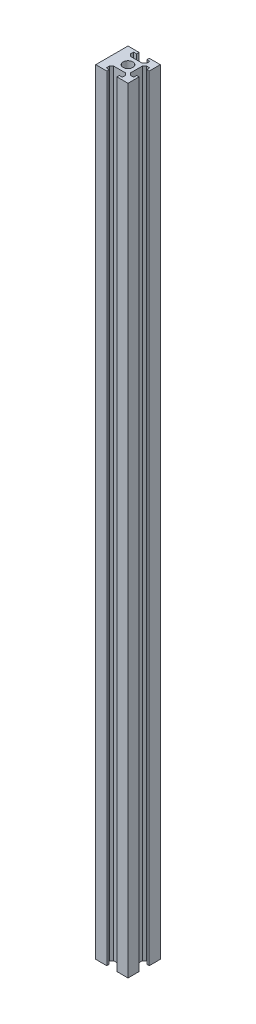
ISO-10303-21;
HEADER;
FILE_DESCRIPTION(('STEP AP214'),'2;1');
FILE_NAME('part.step','',(''),(''),'','','');
FILE_SCHEMA(('AUTOMOTIVE_DESIGN { 1 0 10303 214 1 1 1 1 }'));
ENDSEC;
DATA;
#1=APPLICATION_CONTEXT('core data for automotive mechanical design processes');
#2=APPLICATION_PROTOCOL_DEFINITION('international standard','automotive_design',2000,#1);
#3=PRODUCT_CONTEXT('',#1,'mechanical');
#4=PRODUCT('Part','Part','',(#3));
#5=PRODUCT_RELATED_PRODUCT_CATEGORY('part','',(#4));
#6=PRODUCT_DEFINITION_FORMATION('','',#4);
#7=PRODUCT_DEFINITION_CONTEXT('part definition',#1,'design');
#8=PRODUCT_DEFINITION('design','',#6,#7);
#9=PRODUCT_DEFINITION_SHAPE('','',#8);
#10=(LENGTH_UNIT() NAMED_UNIT(*) SI_UNIT(.MILLI.,.METRE.));
#11=(NAMED_UNIT(*) PLANE_ANGLE_UNIT() SI_UNIT($,.RADIAN.));
#12=(NAMED_UNIT(*) SI_UNIT($,.STERADIAN.) SOLID_ANGLE_UNIT());
#13=UNCERTAINTY_MEASURE_WITH_UNIT(LENGTH_MEASURE(1.E-05),#10,'distance_accuracy_value','');
#14=(GEOMETRIC_REPRESENTATION_CONTEXT(3) GLOBAL_UNCERTAINTY_ASSIGNED_CONTEXT((#13)) GLOBAL_UNIT_ASSIGNED_CONTEXT((#10,
#11,#12)) REPRESENTATION_CONTEXT('',''));
#15=CARTESIAN_POINT('',(0.,0.,0.));
#16=DIRECTION('',(0.,0.,1.));
#17=DIRECTION('',(1.,0.,0.));
#18=AXIS2_PLACEMENT_3D('',#15,#16,#17);
#19=CARTESIAN_POINT('',(0.,480.,0.));
#20=DIRECTION('',(0.,1.,0.));
#21=DIRECTION('',(0.,0.,1.));
#22=AXIS2_PLACEMENT_3D('',#19,#20,#21);
#23=PLANE('',#22);
#24=DIRECTION('',(0.,0.,1.));
#25=VECTOR('',#24,1.);
#26=CARTESIAN_POINT('',(-10.,480.,-10.));
#27=LINE('',#26,#25);
#28=CARTESIAN_POINT('',(-10.,480.,-10.));
#29=VERTEX_POINT('',#28);
#30=CARTESIAN_POINT('',(-10.,480.,10.));
#31=VERTEX_POINT('',#30);
#32=EDGE_CURVE('E353',#29,#31,#27,.T.);
#33=ORIENTED_EDGE('',*,*,#32,.T.);
#34=DIRECTION('',(1.,0.,0.));
#35=VECTOR('',#34,1.);
#36=CARTESIAN_POINT('',(-10.,480.,10.));
#37=LINE('',#36,#35);
#38=CARTESIAN_POINT('',(-3.125,480.,10.));
#39=VERTEX_POINT('',#38);
#40=EDGE_CURVE('E171',#31,#39,#37,.T.);
#41=ORIENTED_EDGE('',*,*,#40,.T.);
#42=DIRECTION('',(0.,0.,-1.));
#43=VECTOR('',#42,1.);
#44=CARTESIAN_POINT('',(-3.125,480.,10.));
#45=LINE('',#44,#43);
#46=CARTESIAN_POINT('',(-3.125,480.,8.5));
#47=VERTEX_POINT('',#46);
#48=EDGE_CURVE('E446',#39,#47,#45,.T.);
#49=ORIENTED_EDGE('',*,*,#48,.T.);
#50=DIRECTION('',(-1.,0.,0.));
#51=VECTOR('',#50,1.);
#52=CARTESIAN_POINT('',(-3.125,480.,8.5));
#53=LINE('',#52,#51);
#54=CARTESIAN_POINT('',(-5.,480.,8.5));
#55=VERTEX_POINT('',#54);
#56=EDGE_CURVE('E465',#47,#55,#53,.T.);
#57=ORIENTED_EDGE('',*,*,#56,.T.);
#58=DIRECTION('',(0.,0.,-1.));
#59=VECTOR('',#58,1.);
#60=CARTESIAN_POINT('',(-5.,480.,8.5));
#61=LINE('',#60,#59);
#62=CARTESIAN_POINT('',(-5.00000000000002,480.,6.50482755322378));
#63=VERTEX_POINT('',#62);
#64=EDGE_CURVE('E462',#55,#63,#61,.T.);
#65=ORIENTED_EDGE('',*,*,#64,.T.);
#66=DIRECTION('',(0.703833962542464,0.,-0.71036452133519));
#67=VECTOR('',#66,1.);
#68=CARTESIAN_POINT('',(-5.00000000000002,480.,6.50482755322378));
#69=LINE('',#68,#67);
#70=CARTESIAN_POINT('',(-3.7071680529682,480.,5.19999999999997));
#71=VERTEX_POINT('',#70);
#72=EDGE_CURVE('E464',#63,#71,#69,.T.);
#73=ORIENTED_EDGE('',*,*,#72,.T.);
#74=DIRECTION('',(1.,0.,0.));
#75=VECTOR('',#74,1.);
#76=CARTESIAN_POINT('',(3.7071680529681,480.,5.20000000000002));
#77=LINE('',#76,#75);
#78=CARTESIAN_POINT('',(3.7071680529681,480.,5.20000000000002));
#79=VERTEX_POINT('',#78);
#80=EDGE_CURVE('E467',#71,#79,#77,.T.);
#81=ORIENTED_EDGE('',*,*,#80,.T.);
#82=DIRECTION('',(0.703833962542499,0.,0.710364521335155));
#83=VECTOR('',#82,1.);
#84=CARTESIAN_POINT('',(5.,480.,6.50482755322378));
#85=LINE('',#84,#83);
#86=CARTESIAN_POINT('',(5.,480.,6.50482755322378));
#87=VERTEX_POINT('',#86);
#88=EDGE_CURVE('E473',#79,#87,#85,.T.);
#89=ORIENTED_EDGE('',*,*,#88,.T.);
#90=DIRECTION('',(0.,0.,1.));
#91=VECTOR('',#90,1.);
#92=CARTESIAN_POINT('',(5.,480.,8.5));
#93=LINE('',#92,#91);
#94=CARTESIAN_POINT('',(5.,480.,8.5));
#95=VERTEX_POINT('',#94);
#96=EDGE_CURVE('E475',#87,#95,#93,.T.);
#97=ORIENTED_EDGE('',*,*,#96,.T.);
#98=DIRECTION('',(-1.,0.,0.));
#99=VECTOR('',#98,1.);
#100=CARTESIAN_POINT('',(3.125,480.,8.5));
#101=LINE('',#100,#99);
#102=CARTESIAN_POINT('',(3.125,480.,8.5));
#103=VERTEX_POINT('',#102);
#104=EDGE_CURVE('E477',#95,#103,#101,.T.);
#105=ORIENTED_EDGE('',*,*,#104,.T.);
#106=DIRECTION('',(0.,0.,1.));
#107=VECTOR('',#106,1.);
#108=CARTESIAN_POINT('',(3.125,480.,10.));
#109=LINE('',#108,#107);
#110=CARTESIAN_POINT('',(3.125,480.,10.));
#111=VERTEX_POINT('',#110);
#112=EDGE_CURVE('E479',#103,#111,#109,.T.);
#113=ORIENTED_EDGE('',*,*,#112,.T.);
#114=DIRECTION('',(1.,0.,0.));
#115=VECTOR('',#114,1.);
#116=CARTESIAN_POINT('',(3.125,480.,10.));
#117=LINE('',#116,#115);
#118=CARTESIAN_POINT('',(10.,480.,10.));
#119=VERTEX_POINT('',#118);
#120=EDGE_CURVE('E481',#111,#119,#117,.T.);
#121=ORIENTED_EDGE('',*,*,#120,.T.);
#122=DIRECTION('',(0.,0.,-1.));
#123=VECTOR('',#122,1.);
#124=CARTESIAN_POINT('',(9.99999999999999,480.,3.12500000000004));
#125=LINE('',#124,#123);
#126=CARTESIAN_POINT('',(9.99999999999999,480.,3.12500000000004));
#127=VERTEX_POINT('',#126);
#128=EDGE_CURVE('E483',#119,#127,#125,.T.);
#129=ORIENTED_EDGE('',*,*,#128,.T.);
#130=DIRECTION('',(-1.,0.,0.));
#131=VECTOR('',#130,1.);
#132=CARTESIAN_POINT('',(9.99999999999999,480.,3.12500000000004));
#133=LINE('',#132,#131);
#134=CARTESIAN_POINT('',(8.49999999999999,480.,3.12500000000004));
#135=VERTEX_POINT('',#134);
#136=EDGE_CURVE('E485',#127,#135,#133,.T.);
#137=ORIENTED_EDGE('',*,*,#136,.T.);
#138=DIRECTION('',(0.,0.,1.));
#139=VECTOR('',#138,1.);
#140=CARTESIAN_POINT('',(8.49999999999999,480.,3.12500000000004));
#141=LINE('',#140,#139);
#142=CARTESIAN_POINT('',(8.49999999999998,480.,5.00000000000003));
#143=VERTEX_POINT('',#142);
#144=EDGE_CURVE('E487',#135,#143,#141,.T.);
#145=ORIENTED_EDGE('',*,*,#144,.T.);
#146=DIRECTION('',(-1.,0.,0.));
#147=VECTOR('',#146,1.);
#148=CARTESIAN_POINT('',(8.49999999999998,480.,5.00000000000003));
#149=LINE('',#148,#147);
#150=CARTESIAN_POINT('',(6.50482755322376,480.,5.00000000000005));
#151=VERTEX_POINT('',#150);
#152=EDGE_CURVE('E489',#143,#151,#149,.T.);
#153=ORIENTED_EDGE('',*,*,#152,.T.);
#154=DIRECTION('',(-0.71036452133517,0.,-0.703833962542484));
#155=VECTOR('',#154,1.);
#156=CARTESIAN_POINT('',(6.50482755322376,480.,5.00000000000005));
#157=LINE('',#156,#155);
#158=CARTESIAN_POINT('',(5.19999999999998,480.,3.70716805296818));
#159=VERTEX_POINT('',#158);
#160=EDGE_CURVE('E491',#151,#159,#157,.T.);
#161=ORIENTED_EDGE('',*,*,#160,.T.);
#162=DIRECTION('',(0.,0.,-1.));
#163=VECTOR('',#162,1.);
#164=CARTESIAN_POINT('',(5.20000000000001,480.,-3.70716805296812));
#165=LINE('',#164,#163);
#166=CARTESIAN_POINT('',(5.20000000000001,480.,-3.70716805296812));
#167=VERTEX_POINT('',#166);
#168=EDGE_CURVE('E493',#159,#167,#165,.T.);
#169=ORIENTED_EDGE('',*,*,#168,.T.);
#170=DIRECTION('',(0.710364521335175,0.,-0.703833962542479));
#171=VECTOR('',#170,1.);
#172=CARTESIAN_POINT('',(6.5048275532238,480.,-4.99999999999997));
#173=LINE('',#172,#171);
#174=CARTESIAN_POINT('',(6.5048275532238,480.,-4.99999999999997));
#175=VERTEX_POINT('',#174);
#176=EDGE_CURVE('E495',#167,#175,#173,.T.);
#177=ORIENTED_EDGE('',*,*,#176,.T.);
#178=DIRECTION('',(1.,0.,0.));
#179=VECTOR('',#178,1.);
#180=CARTESIAN_POINT('',(8.50000000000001,480.,-4.99999999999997));
#181=LINE('',#180,#179);
#182=CARTESIAN_POINT('',(8.50000000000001,480.,-4.99999999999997));
#183=VERTEX_POINT('',#182);
#184=EDGE_CURVE('E497',#175,#183,#181,.T.);
#185=ORIENTED_EDGE('',*,*,#184,.T.);
#186=DIRECTION('',(0.,0.,1.));
#187=VECTOR('',#186,1.);
#188=CARTESIAN_POINT('',(8.50000000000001,480.,-3.12499999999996));
#189=LINE('',#188,#187);
#190=CARTESIAN_POINT('',(8.50000000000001,480.,-3.12499999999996));
#191=VERTEX_POINT('',#190);
#192=EDGE_CURVE('E499',#183,#191,#189,.T.);
#193=ORIENTED_EDGE('',*,*,#192,.T.);
#194=DIRECTION('',(1.,0.,0.));
#195=VECTOR('',#194,1.);
#196=CARTESIAN_POINT('',(10.,480.,-3.12499999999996));
#197=LINE('',#196,#195);
#198=CARTESIAN_POINT('',(10.,480.,-3.12499999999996));
#199=VERTEX_POINT('',#198);
#200=EDGE_CURVE('E501',#191,#199,#197,.T.);
#201=ORIENTED_EDGE('',*,*,#200,.T.);
#202=DIRECTION('',(0.,0.,-1.));
#203=VECTOR('',#202,1.);
#204=CARTESIAN_POINT('',(10.,480.,-10.));
#205=LINE('',#204,#203);
#206=CARTESIAN_POINT('',(10.,480.,-10.));
#207=VERTEX_POINT('',#206);
#208=EDGE_CURVE('E503',#199,#207,#205,.T.);
#209=ORIENTED_EDGE('',*,*,#208,.T.);
#210=DIRECTION('',(-1.,0.,0.));
#211=VECTOR('',#210,1.);
#212=CARTESIAN_POINT('',(3.125,480.,-10.));
#213=LINE('',#212,#211);
#214=CARTESIAN_POINT('',(3.125,480.,-10.));
#215=VERTEX_POINT('',#214);
#216=EDGE_CURVE('E505',#207,#215,#213,.T.);
#217=ORIENTED_EDGE('',*,*,#216,.T.);
#218=DIRECTION('',(0.,0.,1.));
#219=VECTOR('',#218,1.);
#220=CARTESIAN_POINT('',(3.125,480.,-10.));
#221=LINE('',#220,#219);
#222=CARTESIAN_POINT('',(3.12500000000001,480.,-8.5));
#223=VERTEX_POINT('',#222);
#224=EDGE_CURVE('E507',#215,#223,#221,.T.);
#225=ORIENTED_EDGE('',*,*,#224,.T.);
#226=DIRECTION('',(1.,0.,0.));
#227=VECTOR('',#226,1.);
#228=CARTESIAN_POINT('',(3.12500000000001,480.,-8.5));
#229=LINE('',#228,#227);
#230=CARTESIAN_POINT('',(5.00000000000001,480.,-8.5));
#231=VERTEX_POINT('',#230);
#232=EDGE_CURVE('E509',#223,#231,#229,.T.);
#233=ORIENTED_EDGE('',*,*,#232,.T.);
#234=DIRECTION('',(0.,0.,1.));
#235=VECTOR('',#234,1.);
#236=CARTESIAN_POINT('',(5.00000000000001,480.,-8.5));
#237=LINE('',#236,#235);
#238=CARTESIAN_POINT('',(5.00000000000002,480.,-6.50482755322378));
#239=VERTEX_POINT('',#238);
#240=EDGE_CURVE('E511',#231,#239,#237,.T.);
#241=ORIENTED_EDGE('',*,*,#240,.T.);
#242=DIRECTION('',(-0.703833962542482,0.,0.710364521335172));
#243=VECTOR('',#242,1.);
#244=CARTESIAN_POINT('',(5.00000000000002,480.,-6.50482755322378));
#245=LINE('',#244,#243);
#246=CARTESIAN_POINT('',(3.70716805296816,480.,-5.2));
#247=VERTEX_POINT('',#246);
#248=EDGE_CURVE('E513',#239,#247,#245,.T.);
#249=ORIENTED_EDGE('',*,*,#248,.T.);
#250=DIRECTION('',(-1.,0.,0.));
#251=VECTOR('',#250,1.);
#252=CARTESIAN_POINT('',(-3.70716805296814,480.,-5.2));
#253=LINE('',#252,#251);
#254=CARTESIAN_POINT('',(-3.70716805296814,480.,-5.2));
#255=VERTEX_POINT('',#254);
#256=EDGE_CURVE('E515',#247,#255,#253,.T.);
#257=ORIENTED_EDGE('',*,*,#256,.T.);
#258=DIRECTION('',(-0.703833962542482,0.,-0.710364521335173));
#259=VECTOR('',#258,1.);
#260=CARTESIAN_POINT('',(-4.99999999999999,480.,-6.50482755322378));
#261=LINE('',#260,#259);
#262=CARTESIAN_POINT('',(-4.99999999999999,480.,-6.50482755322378));
#263=VERTEX_POINT('',#262);
#264=EDGE_CURVE('E517',#255,#263,#261,.T.);
#265=ORIENTED_EDGE('',*,*,#264,.T.);
#266=DIRECTION('',(0.,0.,-1.));
#267=VECTOR('',#266,1.);
#268=CARTESIAN_POINT('',(-4.99999999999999,480.,-8.5));
#269=LINE('',#268,#267);
#270=CARTESIAN_POINT('',(-4.99999999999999,480.,-8.5));
#271=VERTEX_POINT('',#270);
#272=EDGE_CURVE('E268',#263,#271,#269,.T.);
#273=ORIENTED_EDGE('',*,*,#272,.T.);
#274=DIRECTION('',(1.,0.,0.));
#275=VECTOR('',#274,1.);
#276=CARTESIAN_POINT('',(-3.12499999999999,480.,-8.5));
#277=LINE('',#276,#275);
#278=CARTESIAN_POINT('',(-3.12499999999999,480.,-8.5));
#279=VERTEX_POINT('',#278);
#280=EDGE_CURVE('E262',#271,#279,#277,.T.);
#281=ORIENTED_EDGE('',*,*,#280,.T.);
#282=DIRECTION('',(0.,0.,-1.));
#283=VECTOR('',#282,1.);
#284=CARTESIAN_POINT('',(-3.12499999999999,480.,-10.));
#285=LINE('',#284,#283);
#286=CARTESIAN_POINT('',(-3.12499999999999,480.,-10.));
#287=VERTEX_POINT('',#286);
#288=EDGE_CURVE('E266',#279,#287,#285,.T.);
#289=ORIENTED_EDGE('',*,*,#288,.T.);
#290=DIRECTION('',(-1.,0.,0.));
#291=VECTOR('',#290,1.);
#292=CARTESIAN_POINT('',(-10.,480.,-10.));
#293=LINE('',#292,#291);
#294=EDGE_CURVE('E50',#287,#29,#293,.T.);
#295=ORIENTED_EDGE('',*,*,#294,.T.);
#296=EDGE_LOOP('',(#33,#41,#49,#57,#65,#73,#81,#89,#97,#105,#113,#121,#129,#137,#145,#153,#161,
#169,#177,#185,#193,#201,#209,#217,#225,#233,#241,#249,#257,#265,#273,#281,#289,#295));
#297=FACE_BOUND('',#296,.T.);
#298=CARTESIAN_POINT('',(0.,480.,0.));
#299=DIRECTION('',(0.,1.,0.));
#300=DIRECTION('',(0.,0.,1.));
#301=AXIS2_PLACEMENT_3D('',#298,#299,#300);
#302=CIRCLE('',#301,3.);
#303=CARTESIAN_POINT('',(0.,480.,2.99999999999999));
#304=VERTEX_POINT('',#303);
#305=EDGE_CURVE('E290',#304,#304,#302,.T.);
#306=ORIENTED_EDGE('',*,*,#305,.F.);
#307=EDGE_LOOP('',(#306));
#308=FACE_BOUND('',#307,.T.);
#309=ADVANCED_FACE('F33',(#297,#308),#23,.T.);
#310=CARTESIAN_POINT('',(0.,0.,0.));
#311=DIRECTION('',(0.,1.,0.));
#312=DIRECTION('',(0.,0.,1.));
#313=AXIS2_PLACEMENT_3D('',#310,#311,#312);
#314=PLANE('',#313);
#315=DIRECTION('',(0.,0.,1.));
#316=VECTOR('',#315,1.);
#317=CARTESIAN_POINT('',(-10.,0.,-10.));
#318=LINE('',#317,#316);
#319=CARTESIAN_POINT('',(-10.,0.,-10.));
#320=VERTEX_POINT('',#319);
#321=CARTESIAN_POINT('',(-10.,0.,10.));
#322=VERTEX_POINT('',#321);
#323=EDGE_CURVE('E286',#320,#322,#318,.T.);
#324=ORIENTED_EDGE('',*,*,#323,.F.);
#325=DIRECTION('',(-1.,0.,0.));
#326=VECTOR('',#325,1.);
#327=CARTESIAN_POINT('',(-10.,0.,-10.));
#328=LINE('',#327,#326);
#329=CARTESIAN_POINT('',(-3.12499999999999,0.,-10.));
#330=VERTEX_POINT('',#329);
#331=EDGE_CURVE('E163',#330,#320,#328,.T.);
#332=ORIENTED_EDGE('',*,*,#331,.F.);
#333=DIRECTION('',(0.,0.,-1.));
#334=VECTOR('',#333,1.);
#335=CARTESIAN_POINT('',(-3.12499999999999,0.,-10.));
#336=LINE('',#335,#334);
#337=CARTESIAN_POINT('',(-3.12499999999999,0.,-8.5));
#338=VERTEX_POINT('',#337);
#339=EDGE_CURVE('E157',#338,#330,#336,.T.);
#340=ORIENTED_EDGE('',*,*,#339,.F.);
#341=DIRECTION('',(1.,0.,0.));
#342=VECTOR('',#341,1.);
#343=CARTESIAN_POINT('',(-3.12499999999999,0.,-8.5));
#344=LINE('',#343,#342);
#345=CARTESIAN_POINT('',(-4.99999999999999,0.,-8.5));
#346=VERTEX_POINT('',#345);
#347=EDGE_CURVE('E276',#346,#338,#344,.T.);
#348=ORIENTED_EDGE('',*,*,#347,.F.);
#349=DIRECTION('',(0.,0.,-1.));
#350=VECTOR('',#349,1.);
#351=CARTESIAN_POINT('',(-4.99999999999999,0.,-8.5));
#352=LINE('',#351,#350);
#353=CARTESIAN_POINT('',(-4.99999999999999,0.,-6.50482755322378));
#354=VERTEX_POINT('',#353);
#355=EDGE_CURVE('E348',#354,#346,#352,.T.);
#356=ORIENTED_EDGE('',*,*,#355,.F.);
#357=DIRECTION('',(-0.703833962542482,0.,-0.710364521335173));
#358=VECTOR('',#357,1.);
#359=CARTESIAN_POINT('',(-4.99999999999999,0.,-6.50482755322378));
#360=LINE('',#359,#358);
#361=CARTESIAN_POINT('',(-3.70716805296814,0.,-5.2));
#362=VERTEX_POINT('',#361);
#363=EDGE_CURVE('E346',#362,#354,#360,.T.);
#364=ORIENTED_EDGE('',*,*,#363,.F.);
#365=DIRECTION('',(-1.,0.,0.));
#366=VECTOR('',#365,1.);
#367=CARTESIAN_POINT('',(-3.70716805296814,0.,-5.2));
#368=LINE('',#367,#366);
#369=CARTESIAN_POINT('',(3.70716805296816,0.,-5.2));
#370=VERTEX_POINT('',#369);
#371=EDGE_CURVE('E344',#370,#362,#368,.T.);
#372=ORIENTED_EDGE('',*,*,#371,.F.);
#373=DIRECTION('',(-0.703833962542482,0.,0.710364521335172));
#374=VECTOR('',#373,1.);
#375=CARTESIAN_POINT('',(5.00000000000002,0.,-6.50482755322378));
#376=LINE('',#375,#374);
#377=CARTESIAN_POINT('',(5.00000000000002,0.,-6.50482755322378));
#378=VERTEX_POINT('',#377);
#379=EDGE_CURVE('E342',#378,#370,#376,.T.);
#380=ORIENTED_EDGE('',*,*,#379,.F.);
#381=DIRECTION('',(0.,0.,1.));
#382=VECTOR('',#381,1.);
#383=CARTESIAN_POINT('',(5.00000000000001,0.,-8.5));
#384=LINE('',#383,#382);
#385=CARTESIAN_POINT('',(5.00000000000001,0.,-8.5));
#386=VERTEX_POINT('',#385);
#387=EDGE_CURVE('E340',#386,#378,#384,.T.);
#388=ORIENTED_EDGE('',*,*,#387,.F.);
#389=DIRECTION('',(1.,0.,0.));
#390=VECTOR('',#389,1.);
#391=CARTESIAN_POINT('',(3.12500000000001,0.,-8.5));
#392=LINE('',#391,#390);
#393=CARTESIAN_POINT('',(3.12500000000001,0.,-8.5));
#394=VERTEX_POINT('',#393);
#395=EDGE_CURVE('E338',#394,#386,#392,.T.);
#396=ORIENTED_EDGE('',*,*,#395,.F.);
#397=DIRECTION('',(0.,0.,1.));
#398=VECTOR('',#397,1.);
#399=CARTESIAN_POINT('',(3.125,0.,-10.));
#400=LINE('',#399,#398);
#401=CARTESIAN_POINT('',(3.125,0.,-10.));
#402=VERTEX_POINT('',#401);
#403=EDGE_CURVE('E336',#402,#394,#400,.T.);
#404=ORIENTED_EDGE('',*,*,#403,.F.);
#405=DIRECTION('',(-1.,0.,0.));
#406=VECTOR('',#405,1.);
#407=CARTESIAN_POINT('',(3.125,0.,-10.));
#408=LINE('',#407,#406);
#409=CARTESIAN_POINT('',(10.,0.,-10.));
#410=VERTEX_POINT('',#409);
#411=EDGE_CURVE('E334',#410,#402,#408,.T.);
#412=ORIENTED_EDGE('',*,*,#411,.F.);
#413=DIRECTION('',(0.,0.,-1.));
#414=VECTOR('',#413,1.);
#415=CARTESIAN_POINT('',(10.,0.,-10.));
#416=LINE('',#415,#414);
#417=CARTESIAN_POINT('',(10.,0.,-3.12499999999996));
#418=VERTEX_POINT('',#417);
#419=EDGE_CURVE('E332',#418,#410,#416,.T.);
#420=ORIENTED_EDGE('',*,*,#419,.F.);
#421=DIRECTION('',(1.,0.,0.));
#422=VECTOR('',#421,1.);
#423=CARTESIAN_POINT('',(10.,0.,-3.12499999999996));
#424=LINE('',#423,#422);
#425=CARTESIAN_POINT('',(8.50000000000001,0.,-3.12499999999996));
#426=VERTEX_POINT('',#425);
#427=EDGE_CURVE('E330',#426,#418,#424,.T.);
#428=ORIENTED_EDGE('',*,*,#427,.F.);
#429=DIRECTION('',(0.,0.,1.));
#430=VECTOR('',#429,1.);
#431=CARTESIAN_POINT('',(8.50000000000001,0.,-3.12499999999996));
#432=LINE('',#431,#430);
#433=CARTESIAN_POINT('',(8.50000000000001,0.,-4.99999999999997));
#434=VERTEX_POINT('',#433);
#435=EDGE_CURVE('E328',#434,#426,#432,.T.);
#436=ORIENTED_EDGE('',*,*,#435,.F.);
#437=DIRECTION('',(1.,0.,0.));
#438=VECTOR('',#437,1.);
#439=CARTESIAN_POINT('',(8.50000000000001,0.,-4.99999999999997));
#440=LINE('',#439,#438);
#441=CARTESIAN_POINT('',(6.5048275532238,0.,-4.99999999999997));
#442=VERTEX_POINT('',#441);
#443=EDGE_CURVE('E326',#442,#434,#440,.T.);
#444=ORIENTED_EDGE('',*,*,#443,.F.);
#445=DIRECTION('',(0.710364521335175,0.,-0.703833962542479));
#446=VECTOR('',#445,1.);
#447=CARTESIAN_POINT('',(6.5048275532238,0.,-4.99999999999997));
#448=LINE('',#447,#446);
#449=CARTESIAN_POINT('',(5.20000000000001,0.,-3.70716805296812));
#450=VERTEX_POINT('',#449);
#451=EDGE_CURVE('E324',#450,#442,#448,.T.);
#452=ORIENTED_EDGE('',*,*,#451,.F.);
#453=DIRECTION('',(0.,0.,-1.));
#454=VECTOR('',#453,1.);
#455=CARTESIAN_POINT('',(5.20000000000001,0.,-3.70716805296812));
#456=LINE('',#455,#454);
#457=CARTESIAN_POINT('',(5.19999999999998,0.,3.70716805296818));
#458=VERTEX_POINT('',#457);
#459=EDGE_CURVE('E322',#458,#450,#456,.T.);
#460=ORIENTED_EDGE('',*,*,#459,.F.);
#461=DIRECTION('',(-0.71036452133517,0.,-0.703833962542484));
#462=VECTOR('',#461,1.);
#463=CARTESIAN_POINT('',(6.50482755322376,0.,5.00000000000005));
#464=LINE('',#463,#462);
#465=CARTESIAN_POINT('',(6.50482755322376,0.,5.00000000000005));
#466=VERTEX_POINT('',#465);
#467=EDGE_CURVE('E320',#466,#458,#464,.T.);
#468=ORIENTED_EDGE('',*,*,#467,.F.);
#469=DIRECTION('',(-1.,0.,0.));
#470=VECTOR('',#469,1.);
#471=CARTESIAN_POINT('',(8.49999999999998,0.,5.00000000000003));
#472=LINE('',#471,#470);
#473=CARTESIAN_POINT('',(8.49999999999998,0.,5.00000000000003));
#474=VERTEX_POINT('',#473);
#475=EDGE_CURVE('E318',#474,#466,#472,.T.);
#476=ORIENTED_EDGE('',*,*,#475,.F.);
#477=DIRECTION('',(0.,0.,1.));
#478=VECTOR('',#477,1.);
#479=CARTESIAN_POINT('',(8.49999999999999,0.,3.12500000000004));
#480=LINE('',#479,#478);
#481=CARTESIAN_POINT('',(8.49999999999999,0.,3.12500000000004));
#482=VERTEX_POINT('',#481);
#483=EDGE_CURVE('E316',#482,#474,#480,.T.);
#484=ORIENTED_EDGE('',*,*,#483,.F.);
#485=DIRECTION('',(-1.,0.,0.));
#486=VECTOR('',#485,1.);
#487=CARTESIAN_POINT('',(9.99999999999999,0.,3.12500000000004));
#488=LINE('',#487,#486);
#489=CARTESIAN_POINT('',(9.99999999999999,0.,3.12500000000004));
#490=VERTEX_POINT('',#489);
#491=EDGE_CURVE('E314',#490,#482,#488,.T.);
#492=ORIENTED_EDGE('',*,*,#491,.F.);
#493=DIRECTION('',(0.,0.,-1.));
#494=VECTOR('',#493,1.);
#495=CARTESIAN_POINT('',(9.99999999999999,0.,3.12500000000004));
#496=LINE('',#495,#494);
#497=CARTESIAN_POINT('',(10.,0.,10.));
#498=VERTEX_POINT('',#497);
#499=EDGE_CURVE('E312',#498,#490,#496,.T.);
#500=ORIENTED_EDGE('',*,*,#499,.F.);
#501=DIRECTION('',(1.,0.,0.));
#502=VECTOR('',#501,1.);
#503=CARTESIAN_POINT('',(3.125,0.,10.));
#504=LINE('',#503,#502);
#505=CARTESIAN_POINT('',(3.125,0.,10.));
#506=VERTEX_POINT('',#505);
#507=EDGE_CURVE('E310',#506,#498,#504,.T.);
#508=ORIENTED_EDGE('',*,*,#507,.F.);
#509=DIRECTION('',(0.,0.,1.));
#510=VECTOR('',#509,1.);
#511=CARTESIAN_POINT('',(3.125,0.,10.));
#512=LINE('',#511,#510);
#513=CARTESIAN_POINT('',(3.125,0.,8.5));
#514=VERTEX_POINT('',#513);
#515=EDGE_CURVE('E308',#514,#506,#512,.T.);
#516=ORIENTED_EDGE('',*,*,#515,.F.);
#517=DIRECTION('',(-1.,0.,0.));
#518=VECTOR('',#517,1.);
#519=CARTESIAN_POINT('',(3.125,0.,8.5));
#520=LINE('',#519,#518);
#521=CARTESIAN_POINT('',(5.,0.,8.5));
#522=VERTEX_POINT('',#521);
#523=EDGE_CURVE('E306',#522,#514,#520,.T.);
#524=ORIENTED_EDGE('',*,*,#523,.F.);
#525=DIRECTION('',(0.,0.,1.));
#526=VECTOR('',#525,1.);
#527=CARTESIAN_POINT('',(5.,0.,8.5));
#528=LINE('',#527,#526);
#529=CARTESIAN_POINT('',(5.,0.,6.50482755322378));
#530=VERTEX_POINT('',#529);
#531=EDGE_CURVE('E304',#530,#522,#528,.T.);
#532=ORIENTED_EDGE('',*,*,#531,.F.);
#533=DIRECTION('',(0.703833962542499,0.,0.710364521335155));
#534=VECTOR('',#533,1.);
#535=CARTESIAN_POINT('',(5.,0.,6.50482755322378));
#536=LINE('',#535,#534);
#537=CARTESIAN_POINT('',(3.7071680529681,0.,5.20000000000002));
#538=VERTEX_POINT('',#537);
#539=EDGE_CURVE('E302',#538,#530,#536,.T.);
#540=ORIENTED_EDGE('',*,*,#539,.F.);
#541=DIRECTION('',(1.,0.,0.));
#542=VECTOR('',#541,1.);
#543=CARTESIAN_POINT('',(3.7071680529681,0.,5.20000000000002));
#544=LINE('',#543,#542);
#545=CARTESIAN_POINT('',(-3.7071680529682,0.,5.19999999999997));
#546=VERTEX_POINT('',#545);
#547=EDGE_CURVE('E300',#546,#538,#544,.T.);
#548=ORIENTED_EDGE('',*,*,#547,.F.);
#549=DIRECTION('',(0.703833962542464,0.,-0.71036452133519));
#550=VECTOR('',#549,1.);
#551=CARTESIAN_POINT('',(-5.00000000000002,0.,6.50482755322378));
#552=LINE('',#551,#550);
#553=CARTESIAN_POINT('',(-5.00000000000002,0.,6.50482755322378));
#554=VERTEX_POINT('',#553);
#555=EDGE_CURVE('E298',#554,#546,#552,.T.);
#556=ORIENTED_EDGE('',*,*,#555,.F.);
#557=DIRECTION('',(0.,0.,-1.));
#558=VECTOR('',#557,1.);
#559=CARTESIAN_POINT('',(-5.,0.,8.5));
#560=LINE('',#559,#558);
#561=CARTESIAN_POINT('',(-5.,0.,8.5));
#562=VERTEX_POINT('',#561);
#563=EDGE_CURVE('E296',#562,#554,#560,.T.);
#564=ORIENTED_EDGE('',*,*,#563,.F.);
#565=DIRECTION('',(-1.,0.,0.));
#566=VECTOR('',#565,1.);
#567=CARTESIAN_POINT('',(-3.125,0.,8.5));
#568=LINE('',#567,#566);
#569=CARTESIAN_POINT('',(-3.125,0.,8.5));
#570=VERTEX_POINT('',#569);
#571=EDGE_CURVE('E294',#570,#562,#568,.T.);
#572=ORIENTED_EDGE('',*,*,#571,.F.);
#573=DIRECTION('',(0.,0.,-1.));
#574=VECTOR('',#573,1.);
#575=CARTESIAN_POINT('',(-3.125,0.,10.));
#576=LINE('',#575,#574);
#577=CARTESIAN_POINT('',(-3.125,0.,10.));
#578=VERTEX_POINT('',#577);
#579=EDGE_CURVE('E292',#578,#570,#576,.T.);
#580=ORIENTED_EDGE('',*,*,#579,.F.);
#581=DIRECTION('',(1.,0.,0.));
#582=VECTOR('',#581,1.);
#583=CARTESIAN_POINT('',(-10.,0.,10.));
#584=LINE('',#583,#582);
#585=EDGE_CURVE('E289',#322,#578,#584,.T.);
#586=ORIENTED_EDGE('',*,*,#585,.F.);
#587=EDGE_LOOP('',(#324,#332,#340,#348,#356,#364,#372,#380,#388,#396,#404,#412,#420,#428,#436,
#444,#452,#460,#468,#476,#484,#492,#500,#508,#516,#524,#532,#540,#548,#556,#564,#572,#580,#586));
#588=FACE_BOUND('',#587,.T.);
#589=CARTESIAN_POINT('',(0.,0.,0.));
#590=DIRECTION('',(0.,1.,0.));
#591=DIRECTION('',(0.,0.,1.));
#592=AXIS2_PLACEMENT_3D('',#589,#590,#591);
#593=CIRCLE('',#592,3.);
#594=CARTESIAN_POINT('',(0.,0.,2.99999999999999));
#595=VERTEX_POINT('',#594);
#596=EDGE_CURVE('E950',#595,#595,#593,.T.);
#597=ORIENTED_EDGE('',*,*,#596,.T.);
#598=EDGE_LOOP('',(#597));
#599=FACE_BOUND('',#598,.T.);
#600=ADVANCED_FACE('F450',(#588,#599),#314,.F.);
#601=CARTESIAN_POINT('',(-10.,480.,-10.));
#602=DIRECTION('',(1.,0.,0.));
#603=DIRECTION('',(0.,0.,-1.));
#604=AXIS2_PLACEMENT_3D('',#601,#602,#603);
#605=PLANE('',#604);
#606=ORIENTED_EDGE('',*,*,#323,.T.);
#607=DIRECTION('',(0.,-1.,0.));
#608=VECTOR('',#607,1.);
#609=CARTESIAN_POINT('',(-10.,480.,10.));
#610=LINE('',#609,#608);
#611=EDGE_CURVE('E11',#31,#322,#610,.T.);
#612=ORIENTED_EDGE('',*,*,#611,.F.);
#613=ORIENTED_EDGE('',*,*,#32,.F.);
#614=DIRECTION('',(0.,-1.,0.));
#615=VECTOR('',#614,1.);
#616=CARTESIAN_POINT('',(-10.,480.,-10.));
#617=LINE('',#616,#615);
#618=EDGE_CURVE('E282',#29,#320,#617,.T.);
#619=ORIENTED_EDGE('',*,*,#618,.T.);
#620=EDGE_LOOP('',(#606,#612,#613,#619));
#621=FACE_BOUND('',#620,.T.);
#622=ADVANCED_FACE('F35',(#621),#605,.F.);
#623=CARTESIAN_POINT('',(-10.,480.,10.));
#624=DIRECTION('',(0.,0.,-1.));
#625=DIRECTION('',(-1.,0.,0.));
#626=AXIS2_PLACEMENT_3D('',#623,#624,#625);
#627=PLANE('',#626);
#628=ORIENTED_EDGE('',*,*,#585,.T.);
#629=DIRECTION('',(0.,-1.,0.));
#630=VECTOR('',#629,1.);
#631=CARTESIAN_POINT('',(-3.125,480.,10.));
#632=LINE('',#631,#630);
#633=EDGE_CURVE('E42',#39,#578,#632,.T.);
#634=ORIENTED_EDGE('',*,*,#633,.F.);
#635=ORIENTED_EDGE('',*,*,#40,.F.);
#636=ORIENTED_EDGE('',*,*,#611,.T.);
#637=EDGE_LOOP('',(#628,#634,#635,#636));
#638=FACE_BOUND('',#637,.T.);
#639=ADVANCED_FACE('F551',(#638),#627,.F.);
#640=CARTESIAN_POINT('',(-3.125,480.,10.));
#641=DIRECTION('',(-1.,0.,0.));
#642=DIRECTION('',(0.,0.,1.));
#643=AXIS2_PLACEMENT_3D('',#640,#641,#642);
#644=PLANE('',#643);
#645=ORIENTED_EDGE('',*,*,#579,.T.);
#646=DIRECTION('',(0.,-1.,0.));
#647=VECTOR('',#646,1.);
#648=CARTESIAN_POINT('',(-3.125,480.,8.5));
#649=LINE('',#648,#647);
#650=EDGE_CURVE('E438',#47,#570,#649,.T.);
#651=ORIENTED_EDGE('',*,*,#650,.F.);
#652=ORIENTED_EDGE('',*,*,#48,.F.);
#653=ORIENTED_EDGE('',*,*,#633,.T.);
#654=EDGE_LOOP('',(#645,#651,#652,#653));
#655=FACE_BOUND('',#654,.T.);
#656=ADVANCED_FACE('F444',(#655),#644,.F.);
#657=CARTESIAN_POINT('',(-3.125,480.,8.5));
#658=DIRECTION('',(0.,0.,1.));
#659=DIRECTION('',(1.,0.,0.));
#660=AXIS2_PLACEMENT_3D('',#657,#658,#659);
#661=PLANE('',#660);
#662=ORIENTED_EDGE('',*,*,#571,.T.);
#663=DIRECTION('',(0.,-1.,0.));
#664=VECTOR('',#663,1.);
#665=CARTESIAN_POINT('',(-5.,480.,8.5));
#666=LINE('',#665,#664);
#667=EDGE_CURVE('E435',#55,#562,#666,.T.);
#668=ORIENTED_EDGE('',*,*,#667,.F.);
#669=ORIENTED_EDGE('',*,*,#56,.F.);
#670=ORIENTED_EDGE('',*,*,#650,.T.);
#671=EDGE_LOOP('',(#662,#668,#669,#670));
#672=FACE_BOUND('',#671,.T.);
#673=ADVANCED_FACE('F456',(#672),#661,.F.);
#674=CARTESIAN_POINT('',(-5.,480.,8.5));
#675=DIRECTION('',(-1.,0.,0.));
#676=DIRECTION('',(0.,0.,1.));
#677=AXIS2_PLACEMENT_3D('',#674,#675,#676);
#678=PLANE('',#677);
#679=ORIENTED_EDGE('',*,*,#563,.T.);
#680=DIRECTION('',(0.,-1.,0.));
#681=VECTOR('',#680,1.);
#682=CARTESIAN_POINT('',(-5.00000000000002,480.,6.50482755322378));
#683=LINE('',#682,#681);
#684=EDGE_CURVE('E432',#63,#554,#683,.T.);
#685=ORIENTED_EDGE('',*,*,#684,.F.);
#686=ORIENTED_EDGE('',*,*,#64,.F.);
#687=ORIENTED_EDGE('',*,*,#667,.T.);
#688=EDGE_LOOP('',(#679,#685,#686,#687));
#689=FACE_BOUND('',#688,.T.);
#690=ADVANCED_FACE('F460',(#689),#678,.F.);
#691=CARTESIAN_POINT('',(-5.00000000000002,480.,6.50482755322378));
#692=DIRECTION('',(-0.71036452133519,0.,-0.703833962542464));
#693=DIRECTION('',(-0.703833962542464,0.,0.71036452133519));
#694=AXIS2_PLACEMENT_3D('',#691,#692,#693);
#695=PLANE('',#694);
#696=ORIENTED_EDGE('',*,*,#555,.T.);
#697=DIRECTION('',(0.,-1.,0.));
#698=VECTOR('',#697,1.);
#699=CARTESIAN_POINT('',(-3.7071680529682,480.,5.19999999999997));
#700=LINE('',#699,#698);
#701=EDGE_CURVE('E429',#71,#546,#700,.T.);
#702=ORIENTED_EDGE('',*,*,#701,.F.);
#703=ORIENTED_EDGE('',*,*,#72,.F.);
#704=ORIENTED_EDGE('',*,*,#684,.T.);
#705=EDGE_LOOP('',(#696,#702,#703,#704));
#706=FACE_BOUND('',#705,.T.);
#707=ADVANCED_FACE('F564',(#706),#695,.F.);
#708=CARTESIAN_POINT('',(3.7071680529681,480.,5.20000000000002));
#709=DIRECTION('',(0.,0.,-1.));
#710=DIRECTION('',(-1.,0.,0.));
#711=AXIS2_PLACEMENT_3D('',#708,#709,#710);
#712=PLANE('',#711);
#713=ORIENTED_EDGE('',*,*,#547,.T.);
#714=DIRECTION('',(0.,-1.,0.));
#715=VECTOR('',#714,1.);
#716=CARTESIAN_POINT('',(3.7071680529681,480.,5.20000000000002));
#717=LINE('',#716,#715);
#718=EDGE_CURVE('E426',#79,#538,#717,.T.);
#719=ORIENTED_EDGE('',*,*,#718,.F.);
#720=ORIENTED_EDGE('',*,*,#80,.F.);
#721=ORIENTED_EDGE('',*,*,#701,.T.);
#722=EDGE_LOOP('',(#713,#719,#720,#721));
#723=FACE_BOUND('',#722,.T.);
#724=ADVANCED_FACE('F567',(#723),#712,.F.);
#725=CARTESIAN_POINT('',(5.,480.,6.50482755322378));
#726=DIRECTION('',(0.710364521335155,0.,-0.703833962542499));
#727=DIRECTION('',(-0.703833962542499,0.,-0.710364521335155));
#728=AXIS2_PLACEMENT_3D('',#725,#726,#727);
#729=PLANE('',#728);
#730=ORIENTED_EDGE('',*,*,#539,.T.);
#731=DIRECTION('',(0.,-1.,0.));
#732=VECTOR('',#731,1.);
#733=CARTESIAN_POINT('',(5.,480.,6.50482755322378));
#734=LINE('',#733,#732);
#735=EDGE_CURVE('E423',#87,#530,#734,.T.);
#736=ORIENTED_EDGE('',*,*,#735,.F.);
#737=ORIENTED_EDGE('',*,*,#88,.F.);
#738=ORIENTED_EDGE('',*,*,#718,.T.);
#739=EDGE_LOOP('',(#730,#736,#737,#738));
#740=FACE_BOUND('',#739,.T.);
#741=ADVANCED_FACE('F571',(#740),#729,.F.);
#742=CARTESIAN_POINT('',(5.,480.,8.5));
#743=DIRECTION('',(1.,0.,0.));
#744=DIRECTION('',(0.,0.,-1.));
#745=AXIS2_PLACEMENT_3D('',#742,#743,#744);
#746=PLANE('',#745);
#747=ORIENTED_EDGE('',*,*,#531,.T.);
#748=DIRECTION('',(0.,-1.,0.));
#749=VECTOR('',#748,1.);
#750=CARTESIAN_POINT('',(5.,480.,8.5));
#751=LINE('',#750,#749);
#752=EDGE_CURVE('E420',#95,#522,#751,.T.);
#753=ORIENTED_EDGE('',*,*,#752,.F.);
#754=ORIENTED_EDGE('',*,*,#96,.F.);
#755=ORIENTED_EDGE('',*,*,#735,.T.);
#756=EDGE_LOOP('',(#747,#753,#754,#755));
#757=FACE_BOUND('',#756,.T.);
#758=ADVANCED_FACE('F575',(#757),#746,.F.);
#759=CARTESIAN_POINT('',(3.125,480.,8.5));
#760=DIRECTION('',(0.,0.,1.));
#761=DIRECTION('',(1.,0.,0.));
#762=AXIS2_PLACEMENT_3D('',#759,#760,#761);
#763=PLANE('',#762);
#764=ORIENTED_EDGE('',*,*,#523,.T.);
#765=DIRECTION('',(0.,-1.,0.));
#766=VECTOR('',#765,1.);
#767=CARTESIAN_POINT('',(3.125,480.,8.5));
#768=LINE('',#767,#766);
#769=EDGE_CURVE('E417',#103,#514,#768,.T.);
#770=ORIENTED_EDGE('',*,*,#769,.F.);
#771=ORIENTED_EDGE('',*,*,#104,.F.);
#772=ORIENTED_EDGE('',*,*,#752,.T.);
#773=EDGE_LOOP('',(#764,#770,#771,#772));
#774=FACE_BOUND('',#773,.T.);
#775=ADVANCED_FACE('F579',(#774),#763,.F.);
#776=CARTESIAN_POINT('',(3.125,480.,10.));
#777=DIRECTION('',(1.,0.,0.));
#778=DIRECTION('',(0.,0.,-1.));
#779=AXIS2_PLACEMENT_3D('',#776,#777,#778);
#780=PLANE('',#779);
#781=ORIENTED_EDGE('',*,*,#515,.T.);
#782=DIRECTION('',(0.,-1.,0.));
#783=VECTOR('',#782,1.);
#784=CARTESIAN_POINT('',(3.125,480.,10.));
#785=LINE('',#784,#783);
#786=EDGE_CURVE('E414',#111,#506,#785,.T.);
#787=ORIENTED_EDGE('',*,*,#786,.F.);
#788=ORIENTED_EDGE('',*,*,#112,.F.);
#789=ORIENTED_EDGE('',*,*,#769,.T.);
#790=EDGE_LOOP('',(#781,#787,#788,#789));
#791=FACE_BOUND('',#790,.T.);
#792=ADVANCED_FACE('F583',(#791),#780,.F.);
#793=CARTESIAN_POINT('',(3.125,480.,10.));
#794=DIRECTION('',(0.,0.,-1.));
#795=DIRECTION('',(-1.,0.,0.));
#796=AXIS2_PLACEMENT_3D('',#793,#794,#795);
#797=PLANE('',#796);
#798=ORIENTED_EDGE('',*,*,#507,.T.);
#799=DIRECTION('',(0.,-1.,0.));
#800=VECTOR('',#799,1.);
#801=CARTESIAN_POINT('',(10.,480.,10.));
#802=LINE('',#801,#800);
#803=EDGE_CURVE('E411',#119,#498,#802,.T.);
#804=ORIENTED_EDGE('',*,*,#803,.F.);
#805=ORIENTED_EDGE('',*,*,#120,.F.);
#806=ORIENTED_EDGE('',*,*,#786,.T.);
#807=EDGE_LOOP('',(#798,#804,#805,#806));
#808=FACE_BOUND('',#807,.T.);
#809=ADVANCED_FACE('F587',(#808),#797,.F.);
#810=CARTESIAN_POINT('',(9.99999999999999,480.,3.12500000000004));
#811=DIRECTION('',(-1.,0.,0.));
#812=DIRECTION('',(0.,0.,1.));
#813=AXIS2_PLACEMENT_3D('',#810,#811,#812);
#814=PLANE('',#813);
#815=ORIENTED_EDGE('',*,*,#499,.T.);
#816=DIRECTION('',(0.,-1.,0.));
#817=VECTOR('',#816,1.);
#818=CARTESIAN_POINT('',(9.99999999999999,480.,3.12500000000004));
#819=LINE('',#818,#817);
#820=EDGE_CURVE('E408',#127,#490,#819,.T.);
#821=ORIENTED_EDGE('',*,*,#820,.F.);
#822=ORIENTED_EDGE('',*,*,#128,.F.);
#823=ORIENTED_EDGE('',*,*,#803,.T.);
#824=EDGE_LOOP('',(#815,#821,#822,#823));
#825=FACE_BOUND('',#824,.T.);
#826=ADVANCED_FACE('F591',(#825),#814,.F.);
#827=CARTESIAN_POINT('',(9.99999999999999,480.,3.12500000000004));
#828=DIRECTION('',(0.,0.,1.));
#829=DIRECTION('',(1.,0.,0.));
#830=AXIS2_PLACEMENT_3D('',#827,#828,#829);
#831=PLANE('',#830);
#832=ORIENTED_EDGE('',*,*,#491,.T.);
#833=DIRECTION('',(0.,-1.,0.));
#834=VECTOR('',#833,1.);
#835=CARTESIAN_POINT('',(8.49999999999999,480.,3.12500000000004));
#836=LINE('',#835,#834);
#837=EDGE_CURVE('E405',#135,#482,#836,.T.);
#838=ORIENTED_EDGE('',*,*,#837,.F.);
#839=ORIENTED_EDGE('',*,*,#136,.F.);
#840=ORIENTED_EDGE('',*,*,#820,.T.);
#841=EDGE_LOOP('',(#832,#838,#839,#840));
#842=FACE_BOUND('',#841,.T.);
#843=ADVANCED_FACE('F595',(#842),#831,.F.);
#844=CARTESIAN_POINT('',(8.49999999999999,480.,3.12500000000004));
#845=DIRECTION('',(1.,0.,0.));
#846=DIRECTION('',(0.,0.,-1.));
#847=AXIS2_PLACEMENT_3D('',#844,#845,#846);
#848=PLANE('',#847);
#849=ORIENTED_EDGE('',*,*,#483,.T.);
#850=DIRECTION('',(0.,-1.,0.));
#851=VECTOR('',#850,1.);
#852=CARTESIAN_POINT('',(8.49999999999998,480.,5.00000000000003));
#853=LINE('',#852,#851);
#854=EDGE_CURVE('E402',#143,#474,#853,.T.);
#855=ORIENTED_EDGE('',*,*,#854,.F.);
#856=ORIENTED_EDGE('',*,*,#144,.F.);
#857=ORIENTED_EDGE('',*,*,#837,.T.);
#858=EDGE_LOOP('',(#849,#855,#856,#857));
#859=FACE_BOUND('',#858,.T.);
#860=ADVANCED_FACE('F599',(#859),#848,.F.);
#861=CARTESIAN_POINT('',(8.49999999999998,480.,5.00000000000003));
#862=DIRECTION('',(0.,0.,1.));
#863=DIRECTION('',(1.,0.,0.));
#864=AXIS2_PLACEMENT_3D('',#861,#862,#863);
#865=PLANE('',#864);
#866=ORIENTED_EDGE('',*,*,#475,.T.);
#867=DIRECTION('',(0.,-1.,0.));
#868=VECTOR('',#867,1.);
#869=CARTESIAN_POINT('',(6.50482755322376,480.,5.00000000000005));
#870=LINE('',#869,#868);
#871=EDGE_CURVE('E399',#151,#466,#870,.T.);
#872=ORIENTED_EDGE('',*,*,#871,.F.);
#873=ORIENTED_EDGE('',*,*,#152,.F.);
#874=ORIENTED_EDGE('',*,*,#854,.T.);
#875=EDGE_LOOP('',(#866,#872,#873,#874));
#876=FACE_BOUND('',#875,.T.);
#877=ADVANCED_FACE('F603',(#876),#865,.F.);
#878=CARTESIAN_POINT('',(6.50482755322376,480.,5.00000000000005));
#879=DIRECTION('',(-0.703833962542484,0.,0.71036452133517));
#880=DIRECTION('',(0.71036452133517,0.,0.703833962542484));
#881=AXIS2_PLACEMENT_3D('',#878,#879,#880);
#882=PLANE('',#881);
#883=ORIENTED_EDGE('',*,*,#467,.T.);
#884=DIRECTION('',(0.,-1.,0.));
#885=VECTOR('',#884,1.);
#886=CARTESIAN_POINT('',(5.19999999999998,480.,3.70716805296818));
#887=LINE('',#886,#885);
#888=EDGE_CURVE('E396',#159,#458,#887,.T.);
#889=ORIENTED_EDGE('',*,*,#888,.F.);
#890=ORIENTED_EDGE('',*,*,#160,.F.);
#891=ORIENTED_EDGE('',*,*,#871,.T.);
#892=EDGE_LOOP('',(#883,#889,#890,#891));
#893=FACE_BOUND('',#892,.T.);
#894=ADVANCED_FACE('F607',(#893),#882,.F.);
#895=CARTESIAN_POINT('',(5.20000000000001,480.,-3.70716805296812));
#896=DIRECTION('',(-1.,0.,0.));
#897=DIRECTION('',(0.,0.,1.));
#898=AXIS2_PLACEMENT_3D('',#895,#896,#897);
#899=PLANE('',#898);
#900=ORIENTED_EDGE('',*,*,#459,.T.);
#901=DIRECTION('',(0.,-1.,0.));
#902=VECTOR('',#901,1.);
#903=CARTESIAN_POINT('',(5.20000000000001,480.,-3.70716805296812));
#904=LINE('',#903,#902);
#905=EDGE_CURVE('E393',#167,#450,#904,.T.);
#906=ORIENTED_EDGE('',*,*,#905,.F.);
#907=ORIENTED_EDGE('',*,*,#168,.F.);
#908=ORIENTED_EDGE('',*,*,#888,.T.);
#909=EDGE_LOOP('',(#900,#906,#907,#908));
#910=FACE_BOUND('',#909,.T.);
#911=ADVANCED_FACE('F611',(#910),#899,.F.);
#912=CARTESIAN_POINT('',(6.5048275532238,480.,-4.99999999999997));
#913=DIRECTION('',(-0.703833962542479,0.,-0.710364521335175));
#914=DIRECTION('',(-0.710364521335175,0.,0.703833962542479));
#915=AXIS2_PLACEMENT_3D('',#912,#913,#914);
#916=PLANE('',#915);
#917=ORIENTED_EDGE('',*,*,#451,.T.);
#918=DIRECTION('',(0.,-1.,0.));
#919=VECTOR('',#918,1.);
#920=CARTESIAN_POINT('',(6.5048275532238,480.,-4.99999999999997));
#921=LINE('',#920,#919);
#922=EDGE_CURVE('E390',#175,#442,#921,.T.);
#923=ORIENTED_EDGE('',*,*,#922,.F.);
#924=ORIENTED_EDGE('',*,*,#176,.F.);
#925=ORIENTED_EDGE('',*,*,#905,.T.);
#926=EDGE_LOOP('',(#917,#923,#924,#925));
#927=FACE_BOUND('',#926,.T.);
#928=ADVANCED_FACE('F615',(#927),#916,.F.);
#929=CARTESIAN_POINT('',(8.50000000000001,480.,-4.99999999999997));
#930=DIRECTION('',(0.,0.,-1.));
#931=DIRECTION('',(-1.,0.,0.));
#932=AXIS2_PLACEMENT_3D('',#929,#930,#931);
#933=PLANE('',#932);
#934=ORIENTED_EDGE('',*,*,#443,.T.);
#935=DIRECTION('',(0.,-1.,0.));
#936=VECTOR('',#935,1.);
#937=CARTESIAN_POINT('',(8.50000000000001,480.,-4.99999999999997));
#938=LINE('',#937,#936);
#939=EDGE_CURVE('E387',#183,#434,#938,.T.);
#940=ORIENTED_EDGE('',*,*,#939,.F.);
#941=ORIENTED_EDGE('',*,*,#184,.F.);
#942=ORIENTED_EDGE('',*,*,#922,.T.);
#943=EDGE_LOOP('',(#934,#940,#941,#942));
#944=FACE_BOUND('',#943,.T.);
#945=ADVANCED_FACE('F619',(#944),#933,.F.);
#946=CARTESIAN_POINT('',(8.50000000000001,480.,-3.12499999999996));
#947=DIRECTION('',(1.,0.,0.));
#948=DIRECTION('',(0.,0.,-1.));
#949=AXIS2_PLACEMENT_3D('',#946,#947,#948);
#950=PLANE('',#949);
#951=ORIENTED_EDGE('',*,*,#435,.T.);
#952=DIRECTION('',(0.,-1.,0.));
#953=VECTOR('',#952,1.);
#954=CARTESIAN_POINT('',(8.50000000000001,480.,-3.12499999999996));
#955=LINE('',#954,#953);
#956=EDGE_CURVE('E384',#191,#426,#955,.T.);
#957=ORIENTED_EDGE('',*,*,#956,.F.);
#958=ORIENTED_EDGE('',*,*,#192,.F.);
#959=ORIENTED_EDGE('',*,*,#939,.T.);
#960=EDGE_LOOP('',(#951,#957,#958,#959));
#961=FACE_BOUND('',#960,.T.);
#962=ADVANCED_FACE('F623',(#961),#950,.F.);
#963=CARTESIAN_POINT('',(10.,480.,-3.12499999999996));
#964=DIRECTION('',(0.,0.,-1.));
#965=DIRECTION('',(-1.,0.,0.));
#966=AXIS2_PLACEMENT_3D('',#963,#964,#965);
#967=PLANE('',#966);
#968=ORIENTED_EDGE('',*,*,#427,.T.);
#969=DIRECTION('',(0.,-1.,0.));
#970=VECTOR('',#969,1.);
#971=CARTESIAN_POINT('',(10.,480.,-3.12499999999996));
#972=LINE('',#971,#970);
#973=EDGE_CURVE('E381',#199,#418,#972,.T.);
#974=ORIENTED_EDGE('',*,*,#973,.F.);
#975=ORIENTED_EDGE('',*,*,#200,.F.);
#976=ORIENTED_EDGE('',*,*,#956,.T.);
#977=EDGE_LOOP('',(#968,#974,#975,#976));
#978=FACE_BOUND('',#977,.T.);
#979=ADVANCED_FACE('F627',(#978),#967,.F.);
#980=CARTESIAN_POINT('',(10.,480.,-10.));
#981=DIRECTION('',(-1.,0.,0.));
#982=DIRECTION('',(0.,0.,1.));
#983=AXIS2_PLACEMENT_3D('',#980,#981,#982);
#984=PLANE('',#983);
#985=ORIENTED_EDGE('',*,*,#419,.T.);
#986=DIRECTION('',(0.,-1.,0.));
#987=VECTOR('',#986,1.);
#988=CARTESIAN_POINT('',(10.,480.,-10.));
#989=LINE('',#988,#987);
#990=EDGE_CURVE('E378',#207,#410,#989,.T.);
#991=ORIENTED_EDGE('',*,*,#990,.F.);
#992=ORIENTED_EDGE('',*,*,#208,.F.);
#993=ORIENTED_EDGE('',*,*,#973,.T.);
#994=EDGE_LOOP('',(#985,#991,#992,#993));
#995=FACE_BOUND('',#994,.T.);
#996=ADVANCED_FACE('F631',(#995),#984,.F.);
#997=CARTESIAN_POINT('',(3.125,480.,-10.));
#998=DIRECTION('',(0.,0.,1.));
#999=DIRECTION('',(1.,0.,0.));
#1000=AXIS2_PLACEMENT_3D('',#997,#998,#999);
#1001=PLANE('',#1000);
#1002=ORIENTED_EDGE('',*,*,#411,.T.);
#1003=DIRECTION('',(0.,-1.,0.));
#1004=VECTOR('',#1003,1.);
#1005=CARTESIAN_POINT('',(3.125,480.,-10.));
#1006=LINE('',#1005,#1004);
#1007=EDGE_CURVE('E375',#215,#402,#1006,.T.);
#1008=ORIENTED_EDGE('',*,*,#1007,.F.);
#1009=ORIENTED_EDGE('',*,*,#216,.F.);
#1010=ORIENTED_EDGE('',*,*,#990,.T.);
#1011=EDGE_LOOP('',(#1002,#1008,#1009,#1010));
#1012=FACE_BOUND('',#1011,.T.);
#1013=ADVANCED_FACE('F635',(#1012),#1001,.F.);
#1014=CARTESIAN_POINT('',(3.125,480.,-10.));
#1015=DIRECTION('',(1.,0.,0.));
#1016=DIRECTION('',(0.,0.,-1.));
#1017=AXIS2_PLACEMENT_3D('',#1014,#1015,#1016);
#1018=PLANE('',#1017);
#1019=ORIENTED_EDGE('',*,*,#403,.T.);
#1020=DIRECTION('',(0.,-1.,0.));
#1021=VECTOR('',#1020,1.);
#1022=CARTESIAN_POINT('',(3.12500000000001,480.,-8.5));
#1023=LINE('',#1022,#1021);
#1024=EDGE_CURVE('E372',#223,#394,#1023,.T.);
#1025=ORIENTED_EDGE('',*,*,#1024,.F.);
#1026=ORIENTED_EDGE('',*,*,#224,.F.);
#1027=ORIENTED_EDGE('',*,*,#1007,.T.);
#1028=EDGE_LOOP('',(#1019,#1025,#1026,#1027));
#1029=FACE_BOUND('',#1028,.T.);
#1030=ADVANCED_FACE('F639',(#1029),#1018,.F.);
#1031=CARTESIAN_POINT('',(3.12500000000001,480.,-8.5));
#1032=DIRECTION('',(0.,0.,-1.));
#1033=DIRECTION('',(-1.,0.,0.));
#1034=AXIS2_PLACEMENT_3D('',#1031,#1032,#1033);
#1035=PLANE('',#1034);
#1036=ORIENTED_EDGE('',*,*,#395,.T.);
#1037=DIRECTION('',(0.,-1.,0.));
#1038=VECTOR('',#1037,1.);
#1039=CARTESIAN_POINT('',(5.00000000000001,480.,-8.5));
#1040=LINE('',#1039,#1038);
#1041=EDGE_CURVE('E369',#231,#386,#1040,.T.);
#1042=ORIENTED_EDGE('',*,*,#1041,.F.);
#1043=ORIENTED_EDGE('',*,*,#232,.F.);
#1044=ORIENTED_EDGE('',*,*,#1024,.T.);
#1045=EDGE_LOOP('',(#1036,#1042,#1043,#1044));
#1046=FACE_BOUND('',#1045,.T.);
#1047=ADVANCED_FACE('F643',(#1046),#1035,.F.);
#1048=CARTESIAN_POINT('',(5.00000000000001,480.,-8.5));
#1049=DIRECTION('',(1.,0.,0.));
#1050=DIRECTION('',(0.,0.,-1.));
#1051=AXIS2_PLACEMENT_3D('',#1048,#1049,#1050);
#1052=PLANE('',#1051);
#1053=ORIENTED_EDGE('',*,*,#387,.T.);
#1054=DIRECTION('',(0.,-1.,0.));
#1055=VECTOR('',#1054,1.);
#1056=CARTESIAN_POINT('',(5.00000000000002,480.,-6.50482755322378));
#1057=LINE('',#1056,#1055);
#1058=EDGE_CURVE('E366',#239,#378,#1057,.T.);
#1059=ORIENTED_EDGE('',*,*,#1058,.F.);
#1060=ORIENTED_EDGE('',*,*,#240,.F.);
#1061=ORIENTED_EDGE('',*,*,#1041,.T.);
#1062=EDGE_LOOP('',(#1053,#1059,#1060,#1061));
#1063=FACE_BOUND('',#1062,.T.);
#1064=ADVANCED_FACE('F647',(#1063),#1052,.F.);
#1065=CARTESIAN_POINT('',(5.00000000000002,480.,-6.50482755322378));
#1066=DIRECTION('',(0.710364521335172,0.,0.703833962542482));
#1067=DIRECTION('',(0.703833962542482,0.,-0.710364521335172));
#1068=AXIS2_PLACEMENT_3D('',#1065,#1066,#1067);
#1069=PLANE('',#1068);
#1070=ORIENTED_EDGE('',*,*,#379,.T.);
#1071=DIRECTION('',(0.,-1.,0.));
#1072=VECTOR('',#1071,1.);
#1073=CARTESIAN_POINT('',(3.70716805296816,480.,-5.2));
#1074=LINE('',#1073,#1072);
#1075=EDGE_CURVE('E363',#247,#370,#1074,.T.);
#1076=ORIENTED_EDGE('',*,*,#1075,.F.);
#1077=ORIENTED_EDGE('',*,*,#248,.F.);
#1078=ORIENTED_EDGE('',*,*,#1058,.T.);
#1079=EDGE_LOOP('',(#1070,#1076,#1077,#1078));
#1080=FACE_BOUND('',#1079,.T.);
#1081=ADVANCED_FACE('F651',(#1080),#1069,.F.);
#1082=CARTESIAN_POINT('',(-3.70716805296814,480.,-5.2));
#1083=DIRECTION('',(0.,0.,1.));
#1084=DIRECTION('',(1.,0.,0.));
#1085=AXIS2_PLACEMENT_3D('',#1082,#1083,#1084);
#1086=PLANE('',#1085);
#1087=ORIENTED_EDGE('',*,*,#371,.T.);
#1088=DIRECTION('',(0.,-1.,0.));
#1089=VECTOR('',#1088,1.);
#1090=CARTESIAN_POINT('',(-3.70716805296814,480.,-5.2));
#1091=LINE('',#1090,#1089);
#1092=EDGE_CURVE('E360',#255,#362,#1091,.T.);
#1093=ORIENTED_EDGE('',*,*,#1092,.F.);
#1094=ORIENTED_EDGE('',*,*,#256,.F.);
#1095=ORIENTED_EDGE('',*,*,#1075,.T.);
#1096=EDGE_LOOP('',(#1087,#1093,#1094,#1095));
#1097=FACE_BOUND('',#1096,.T.);
#1098=ADVANCED_FACE('F655',(#1097),#1086,.F.);
#1099=CARTESIAN_POINT('',(-4.99999999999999,480.,-6.50482755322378));
#1100=DIRECTION('',(-0.710364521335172,0.,0.703833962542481));
#1101=DIRECTION('',(0.703833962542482,0.,0.710364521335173));
#1102=AXIS2_PLACEMENT_3D('',#1099,#1100,#1101);
#1103=PLANE('',#1102);
#1104=ORIENTED_EDGE('',*,*,#363,.T.);
#1105=DIRECTION('',(0.,-1.,0.));
#1106=VECTOR('',#1105,1.);
#1107=CARTESIAN_POINT('',(-4.99999999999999,480.,-6.50482755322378));
#1108=LINE('',#1107,#1106);
#1109=EDGE_CURVE('E357',#263,#354,#1108,.T.);
#1110=ORIENTED_EDGE('',*,*,#1109,.F.);
#1111=ORIENTED_EDGE('',*,*,#264,.F.);
#1112=ORIENTED_EDGE('',*,*,#1092,.T.);
#1113=EDGE_LOOP('',(#1104,#1110,#1111,#1112));
#1114=FACE_BOUND('',#1113,.T.);
#1115=ADVANCED_FACE('F523',(#1114),#1103,.F.);
#1116=CARTESIAN_POINT('',(-4.99999999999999,480.,-8.5));
#1117=DIRECTION('',(-1.,0.,0.));
#1118=DIRECTION('',(0.,0.,1.));
#1119=AXIS2_PLACEMENT_3D('',#1116,#1117,#1118);
#1120=PLANE('',#1119);
#1121=ORIENTED_EDGE('',*,*,#355,.T.);
#1122=DIRECTION('',(0.,-1.,0.));
#1123=VECTOR('',#1122,1.);
#1124=CARTESIAN_POINT('',(-4.99999999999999,480.,-8.5));
#1125=LINE('',#1124,#1123);
#1126=EDGE_CURVE('E277',#271,#346,#1125,.T.);
#1127=ORIENTED_EDGE('',*,*,#1126,.F.);
#1128=ORIENTED_EDGE('',*,*,#272,.F.);
#1129=ORIENTED_EDGE('',*,*,#1109,.T.);
#1130=EDGE_LOOP('',(#1121,#1127,#1128,#1129));
#1131=FACE_BOUND('',#1130,.T.);
#1132=ADVANCED_FACE('F527',(#1131),#1120,.F.);
#1133=CARTESIAN_POINT('',(-3.12499999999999,480.,-8.5));
#1134=DIRECTION('',(0.,0.,-1.));
#1135=DIRECTION('',(-1.,0.,0.));
#1136=AXIS2_PLACEMENT_3D('',#1133,#1134,#1135);
#1137=PLANE('',#1136);
#1138=ORIENTED_EDGE('',*,*,#347,.T.);
#1139=DIRECTION('',(0.,-1.,0.));
#1140=VECTOR('',#1139,1.);
#1141=CARTESIAN_POINT('',(-3.12499999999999,480.,-8.5));
#1142=LINE('',#1141,#1140);
#1143=EDGE_CURVE('E273',#279,#338,#1142,.T.);
#1144=ORIENTED_EDGE('',*,*,#1143,.F.);
#1145=ORIENTED_EDGE('',*,*,#280,.F.);
#1146=ORIENTED_EDGE('',*,*,#1126,.T.);
#1147=EDGE_LOOP('',(#1138,#1144,#1145,#1146));
#1148=FACE_BOUND('',#1147,.T.);
#1149=ADVANCED_FACE('F274',(#1148),#1137,.F.);
#1150=CARTESIAN_POINT('',(-3.12499999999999,480.,-10.));
#1151=DIRECTION('',(-1.,0.,0.));
#1152=DIRECTION('',(0.,0.,1.));
#1153=AXIS2_PLACEMENT_3D('',#1150,#1151,#1152);
#1154=PLANE('',#1153);
#1155=ORIENTED_EDGE('',*,*,#339,.T.);
#1156=DIRECTION('',(0.,-1.,0.));
#1157=VECTOR('',#1156,1.);
#1158=CARTESIAN_POINT('',(-3.12499999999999,480.,-10.));
#1159=LINE('',#1158,#1157);
#1160=EDGE_CURVE('E278',#287,#330,#1159,.T.);
#1161=ORIENTED_EDGE('',*,*,#1160,.F.);
#1162=ORIENTED_EDGE('',*,*,#288,.F.);
#1163=ORIENTED_EDGE('',*,*,#1143,.T.);
#1164=EDGE_LOOP('',(#1155,#1161,#1162,#1163));
#1165=FACE_BOUND('',#1164,.T.);
#1166=ADVANCED_FACE('F280',(#1165),#1154,.F.);
#1167=CARTESIAN_POINT('',(-10.,480.,-10.));
#1168=DIRECTION('',(0.,0.,1.));
#1169=DIRECTION('',(1.,0.,0.));
#1170=AXIS2_PLACEMENT_3D('',#1167,#1168,#1169);
#1171=PLANE('',#1170);
#1172=ORIENTED_EDGE('',*,*,#331,.T.);
#1173=ORIENTED_EDGE('',*,*,#618,.F.);
#1174=ORIENTED_EDGE('',*,*,#294,.F.);
#1175=ORIENTED_EDGE('',*,*,#1160,.T.);
#1176=EDGE_LOOP('',(#1172,#1173,#1174,#1175));
#1177=FACE_BOUND('',#1176,.T.);
#1178=ADVANCED_FACE('F531',(#1177),#1171,.F.);
#1179=CARTESIAN_POINT('',(0.,480.,0.));
#1180=DIRECTION('',(0.,-1.,0.));
#1181=DIRECTION('',(0.,0.,-1.));
#1182=AXIS2_PLACEMENT_3D('',#1179,#1180,#1181);
#1183=CYLINDRICAL_SURFACE('',#1182,3.);
#1184=ORIENTED_EDGE('',*,*,#305,.T.);
#1185=EDGE_LOOP('',(#1184));
#1186=FACE_BOUND('',#1185,.T.);
#1187=ORIENTED_EDGE('',*,*,#596,.F.);
#1188=EDGE_LOOP('',(#1187));
#1189=FACE_BOUND('',#1188,.T.);
#1190=ADVANCED_FACE('F533',(#1186,#1189),#1183,.F.);
#1191=CLOSED_SHELL('',(#309,#600,#622,#639,#656,#673,#690,#707,#724,#741,#758,#775,#792,#809,
#826,#843,#860,#877,#894,#911,#928,#945,#962,#979,#996,#1013,#1030,#1047,#1064,#1081,#1098,
#1115,#1132,#1149,#1166,#1178,#1190));
#1192=MANIFOLD_SOLID_BREP('B2',#1191);
#1193=ADVANCED_BREP_SHAPE_REPRESENTATION('',(#18,#1192),#14);
#1194=SHAPE_DEFINITION_REPRESENTATION(#9,#1193);
ENDSEC;
END-ISO-10303-21;
